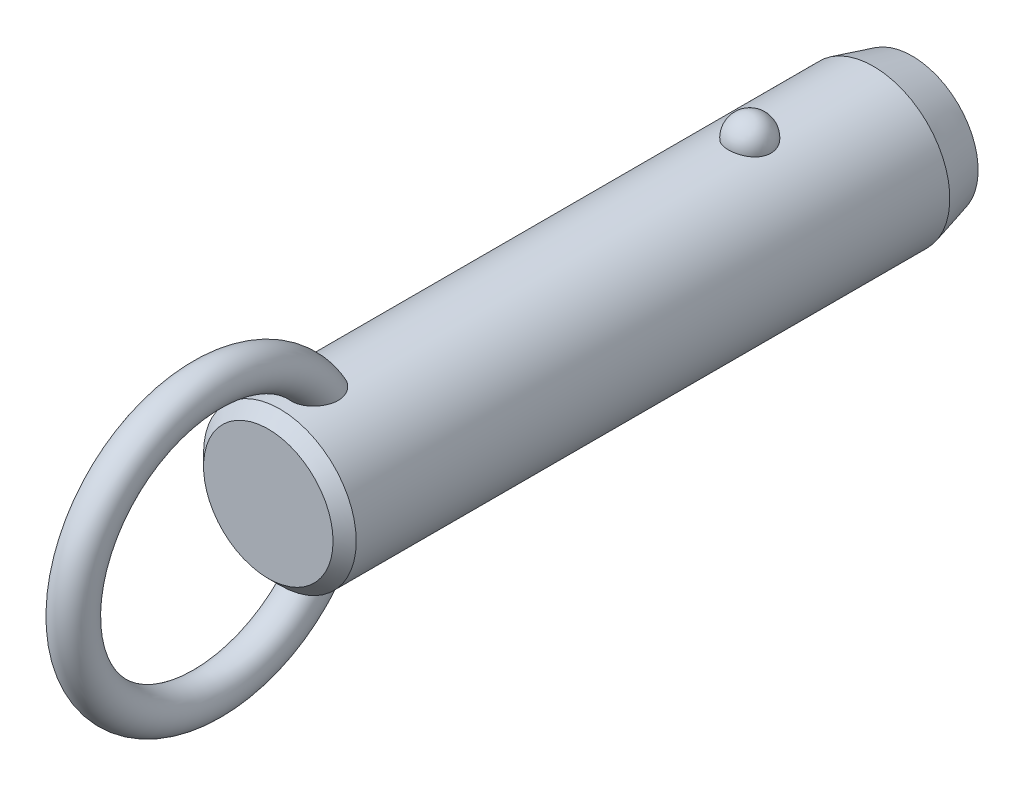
ISO-10303-21;
HEADER;
FILE_DESCRIPTION(('STEP AP214'),'2;1');
FILE_NAME('part.step','',(''),(''),'','','');
FILE_SCHEMA(('AUTOMOTIVE_DESIGN { 1 0 10303 214 1 1 1 1 }'));
ENDSEC;
DATA;
#1=APPLICATION_CONTEXT('core data for automotive mechanical design processes');
#2=APPLICATION_PROTOCOL_DEFINITION('international standard','automotive_design',2000,#1);
#3=PRODUCT_CONTEXT('',#1,'mechanical');
#4=PRODUCT('Part','Part','',(#3));
#5=PRODUCT_RELATED_PRODUCT_CATEGORY('part','',(#4));
#6=PRODUCT_DEFINITION_FORMATION('','',#4);
#7=PRODUCT_DEFINITION_CONTEXT('part definition',#1,'design');
#8=PRODUCT_DEFINITION('design','',#6,#7);
#9=PRODUCT_DEFINITION_SHAPE('','',#8);
#10=(LENGTH_UNIT() NAMED_UNIT(*) SI_UNIT(.MILLI.,.METRE.));
#11=(NAMED_UNIT(*) PLANE_ANGLE_UNIT() SI_UNIT($,.RADIAN.));
#12=(NAMED_UNIT(*) SI_UNIT($,.STERADIAN.) SOLID_ANGLE_UNIT());
#13=UNCERTAINTY_MEASURE_WITH_UNIT(LENGTH_MEASURE(1.E-05),#10,'distance_accuracy_value','');
#14=(GEOMETRIC_REPRESENTATION_CONTEXT(3) GLOBAL_UNCERTAINTY_ASSIGNED_CONTEXT((#13)) GLOBAL_UNIT_ASSIGNED_CONTEXT((#10,
#11,#12)) REPRESENTATION_CONTEXT('',''));
#15=CARTESIAN_POINT('',(0.,0.,0.));
#16=DIRECTION('',(0.,0.,1.));
#17=DIRECTION('',(1.,0.,0.));
#18=AXIS2_PLACEMENT_3D('',#15,#16,#17);
#19=CARTESIAN_POINT('',(0.,0.,38.1));
#20=DIRECTION('',(0.,0.,-1.));
#21=DIRECTION('',(-1.,0.,0.));
#22=AXIS2_PLACEMENT_3D('',#19,#20,#21);
#23=CYLINDRICAL_SURFACE('',#22,7.9);
#24=CARTESIAN_POINT('',(2.1785689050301,7.59367088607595,-2.2));
#25=CARTESIAN_POINT('',(2.17856679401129,7.59367269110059,-2.07701843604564));
#26=CARTESIAN_POINT('',(2.16853481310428,7.59657145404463,-1.95401006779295));
#27=CARTESIAN_POINT('',(2.12864689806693,7.607843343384,-1.71147811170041));
#28=CARTESIAN_POINT('',(2.09878338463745,7.61621856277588,-1.59195587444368));
#29=CARTESIAN_POINT('',(2.0199931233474,7.63749180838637,-1.35985638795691));
#30=CARTESIAN_POINT('',(1.97107475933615,7.6503878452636,-1.24727610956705));
#31=CARTESIAN_POINT('',(1.85539377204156,7.67926115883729,-1.03213234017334));
#32=CARTESIAN_POINT('',(1.78863158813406,7.69523835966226,-0.929568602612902));
#33=CARTESIAN_POINT('',(1.63856494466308,7.7285848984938,-0.736786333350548));
#34=CARTESIAN_POINT('',(1.55518140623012,7.7459606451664,-0.646630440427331));
#35=CARTESIAN_POINT('',(1.37422937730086,7.78009978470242,-0.481747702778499));
#36=CARTESIAN_POINT('',(1.27666086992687,7.79686317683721,-0.407020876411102));
#37=CARTESIAN_POINT('',(1.07024728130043,7.82786153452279,-0.27527810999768));
#38=CARTESIAN_POINT('',(0.961434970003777,7.84210353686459,-0.218212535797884));
#39=CARTESIAN_POINT('',(0.735351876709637,7.86652194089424,-0.123146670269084));
#40=CARTESIAN_POINT('',(0.618082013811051,7.87669878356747,-0.0851443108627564));
#41=CARTESIAN_POINT('',(0.380637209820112,7.89170521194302,-0.0298158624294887));
#42=CARTESIAN_POINT('',(0.260550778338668,7.89662650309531,-0.0121347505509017));
#43=CARTESIAN_POINT('',(0.0190117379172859,7.90090003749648,0.00324379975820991));
#44=CARTESIAN_POINT('',(-0.102440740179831,7.90025280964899,0.000943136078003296));
#45=CARTESIAN_POINT('',(-0.341452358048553,7.89351056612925,-0.0233955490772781));
#46=CARTESIAN_POINT('',(-0.459042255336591,7.88749257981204,-0.0451545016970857));
#47=CARTESIAN_POINT('',(-0.688796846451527,7.87075812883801,-0.107408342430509));
#48=CARTESIAN_POINT('',(-0.800961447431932,7.86004158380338,-0.147903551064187));
#49=CARTESIAN_POINT('',(-1.01743634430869,7.83497131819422,-0.246799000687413));
#50=CARTESIAN_POINT('',(-1.12169791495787,7.82059709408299,-0.305300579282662));
#51=CARTESIAN_POINT('',(-1.31891765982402,7.78976470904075,-0.438549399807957));
#52=CARTESIAN_POINT('',(-1.41187469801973,7.77330633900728,-0.51329827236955));
#53=CARTESIAN_POINT('',(-1.58577142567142,7.73972434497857,-0.67862264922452));
#54=CARTESIAN_POINT('',(-1.66645140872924,7.72259402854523,-0.769470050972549));
#55=CARTESIAN_POINT('',(-1.81161503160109,7.68983776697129,-0.963538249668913));
#56=CARTESIAN_POINT('',(-1.87609753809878,7.6742119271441,-1.06675991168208));
#57=CARTESIAN_POINT('',(-1.98790138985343,7.6460202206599,-1.28401170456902));
#58=CARTESIAN_POINT('',(-2.03501994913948,7.63349104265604,-1.39815107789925));
#59=CARTESIAN_POINT('',(-2.10986724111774,7.6131449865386,-1.63301784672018));
#60=CARTESIAN_POINT('',(-2.1375965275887,7.60532797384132,-1.75374505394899));
#61=CARTESIAN_POINT('',(-2.17289256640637,7.59531950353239,-1.99782562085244));
#62=CARTESIAN_POINT('',(-2.18054294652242,7.59310471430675,-2.12116592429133));
#63=CARTESIAN_POINT('',(-2.17572919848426,7.59448538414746,-2.36741799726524));
#64=CARTESIAN_POINT('',(-2.1632656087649,7.59808068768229,-2.49032977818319));
#65=CARTESIAN_POINT('',(-2.11865035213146,7.61064035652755,-2.73161015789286));
#66=CARTESIAN_POINT('',(-2.08659579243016,7.61957823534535,-2.84999812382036));
#67=CARTESIAN_POINT('',(-2.00367799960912,7.64179982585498,-3.07955956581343));
#68=CARTESIAN_POINT('',(-1.9528140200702,7.65508371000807,-3.19073275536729));
#69=CARTESIAN_POINT('',(-1.83321113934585,7.68460381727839,-3.40337899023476));
#70=CARTESIAN_POINT('',(-1.76437735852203,7.70085556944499,-3.50479651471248));
#71=CARTESIAN_POINT('',(-1.61069526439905,7.73445734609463,-3.69446912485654));
#72=CARTESIAN_POINT('',(-1.52584634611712,7.75180741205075,-3.78272371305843));
#73=CARTESIAN_POINT('',(-1.34198059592,7.78574608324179,-3.94393987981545));
#74=CARTESIAN_POINT('',(-1.24291308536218,7.80233167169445,-4.01684434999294));
#75=CARTESIAN_POINT('',(-1.03352039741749,7.83281625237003,-4.14489386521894));
#76=CARTESIAN_POINT('',(-0.923196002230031,7.84671543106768,-4.20004014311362));
#77=CARTESIAN_POINT('',(-0.695822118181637,7.87011575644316,-4.29042017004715));
#78=CARTESIAN_POINT('',(-0.578872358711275,7.87966903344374,-4.32589112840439));
#79=CARTESIAN_POINT('',(-0.340410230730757,7.8935652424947,-4.37692226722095));
#80=CARTESIAN_POINT('',(-0.218898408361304,7.89790879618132,-4.39248482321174));
#81=CARTESIAN_POINT('',(0.0228107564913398,7.90087453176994,-4.4031440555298));
#82=CARTESIAN_POINT('',(0.142990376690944,7.89960185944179,-4.3986168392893));
#83=CARTESIAN_POINT('',(0.380829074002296,7.89171262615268,-4.37008293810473));
#84=CARTESIAN_POINT('',(0.498488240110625,7.8850962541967,-4.34607694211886));
#85=CARTESIAN_POINT('',(0.727535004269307,7.86726442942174,-4.27939317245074));
#86=CARTESIAN_POINT('',(0.838944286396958,7.85606616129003,-4.23678512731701));
#87=CARTESIAN_POINT('',(1.05295421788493,7.83025654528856,-4.13408348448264));
#88=CARTESIAN_POINT('',(1.15555431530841,7.81564498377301,-4.07398879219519));
#89=CARTESIAN_POINT('',(1.35076763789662,7.7843022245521,-3.93687432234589));
#90=CARTESIAN_POINT('',(1.4432046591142,7.76754209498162,-3.85961036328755));
#91=CARTESIAN_POINT('',(1.6139111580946,7.73387857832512,-3.69076949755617));
#92=CARTESIAN_POINT('',(1.6921781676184,7.71697516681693,-3.59919010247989));
#93=CARTESIAN_POINT('',(1.83380875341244,7.6845643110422,-3.40247278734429));
#94=CARTESIAN_POINT('',(1.89689280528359,7.66908588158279,-3.29712873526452));
#95=CARTESIAN_POINT('',(2.0047823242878,7.64159441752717,-3.07707931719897));
#96=CARTESIAN_POINT('',(2.0495945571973,7.62958010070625,-2.96237743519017));
#97=CARTESIAN_POINT('',(2.11580183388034,7.61146617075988,-2.74040519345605));
#98=CARTESIAN_POINT('',(2.13929812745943,7.60484503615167,-2.63379846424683));
#99=CARTESIAN_POINT('',(2.17068242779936,7.59594664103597,-2.41813481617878));
#100=CARTESIAN_POINT('',(2.17857077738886,7.59366928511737,-2.30907795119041));
#101=CARTESIAN_POINT('',(2.1785689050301,7.59367088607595,-2.2));
#102=B_SPLINE_CURVE_WITH_KNOTS('',3,(#24,#25,#26,#27,#28,#29,#30,#31,#32,#33,#34,#35,#36,#37,
#38,#39,#40,#41,#42,#43,#44,#45,#46,#47,#48,#49,#50,#51,#52,#53,#54,#55,#56,#57,#58,#59,#60,#61,
#62,#63,#64,#65,#66,#67,#68,#69,#70,#71,#72,#73,#74,#75,#76,#77,#78,#79,#80,#81,#82,#83,#84,#85,
#86,#87,#88,#89,#90,#91,#92,#93,#94,#95,#96,#97,#98,#99,#100,#101),.UNSPECIFIED.,.T.,.F.,(4,2,2,
2,2,2,2,2,2,2,2,2,2,2,2,2,2,2,2,2,2,2,2,2,2,2,2,2,2,2,2,2,2,2,2,2,2,2,4),(0.,0.368552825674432,
0.737246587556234,1.10577831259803,1.4743009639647,1.84462067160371,2.21494081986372,
2.5842105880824,2.95344028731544,3.31611630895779,3.67875788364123,4.03628044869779,
4.39380913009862,4.75338791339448,5.11300280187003,5.47939989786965,5.8458226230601,
6.21639834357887,6.58696347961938,6.95598276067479,7.32499216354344,7.69218715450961,
8.0593967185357,8.42858578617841,8.79778880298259,9.16834203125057,9.5388695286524,
9.90482699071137,10.2707407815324,10.6298333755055,10.9889132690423,11.3466585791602,
11.7044262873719,12.0676511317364,12.4309391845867,12.8004764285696,13.1698767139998,
13.4967701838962,13.8236564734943),.UNSPECIFIED.);
#103=CARTESIAN_POINT('',(2.1785689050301,7.59367088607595,-2.2));
#104=VERTEX_POINT('',#103);
#105=EDGE_CURVE('E41',#104,#104,#102,.T.);
#106=ORIENTED_EDGE('',*,*,#105,.T.);
#107=EDGE_LOOP('',(#106));
#108=FACE_BOUND('',#107,.T.);
#109=CARTESIAN_POINT('',(0.,0.,46.42));
#110=DIRECTION('',(0.,0.,1.));
#111=DIRECTION('',(1.,0.,0.));
#112=AXIS2_PLACEMENT_3D('',#109,#110,#111);
#113=CIRCLE('',#112,7.9);
#114=CARTESIAN_POINT('',(7.9,0.,46.42));
#115=VERTEX_POINT('',#114);
#116=EDGE_CURVE('E10',#115,#115,#113,.F.);
#117=ORIENTED_EDGE('',*,*,#116,.T.);
#118=EDGE_LOOP('',(#117));
#119=FACE_BOUND('',#118,.T.);
#120=CARTESIAN_POINT('',(-0.63096985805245,-7.87476203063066,40.3124322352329));
#121=CARTESIAN_POINT('',(-0.734180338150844,-7.8664899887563,40.347285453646));
#122=CARTESIAN_POINT('',(-0.834476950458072,-7.85639291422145,40.3908160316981));
#123=CARTESIAN_POINT('',(-1.0262035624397,-7.83366343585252,40.4940948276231));
#124=CARTESIAN_POINT('',(-1.1176141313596,-7.82102565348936,40.5538775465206));
#125=CARTESIAN_POINT('',(-1.28877277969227,-7.79464922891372,40.6878390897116));
#126=CARTESIAN_POINT('',(-1.36854014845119,-7.78091246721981,40.761993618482));
#127=CARTESIAN_POINT('',(-1.51461521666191,-7.75380398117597,40.9224941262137));
#128=CARTESIAN_POINT('',(-1.58092966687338,-7.74043207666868,41.0088339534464));
#129=CARTESIAN_POINT('',(-1.70019064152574,-7.7151252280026,41.1929784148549));
#130=CARTESIAN_POINT('',(-1.75284037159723,-7.70322473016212,41.2909792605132));
#131=CARTESIAN_POINT('',(-1.84263464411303,-7.68224112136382,41.4941029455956));
#132=CARTESIAN_POINT('',(-1.87977299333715,-7.6731591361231,41.5992286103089));
#133=CARTESIAN_POINT('',(-1.94152728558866,-7.65777930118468,41.8232849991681));
#134=CARTESIAN_POINT('',(-1.96475471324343,-7.65179654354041,41.9426167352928));
#135=CARTESIAN_POINT('',(-1.99449499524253,-7.64409642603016,42.1834298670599));
#136=CARTESIAN_POINT('',(-2.0010005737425,-7.64238092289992,42.3049121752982));
#137=CARTESIAN_POINT('',(-1.99856014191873,-7.64302120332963,42.5683409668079));
#138=CARTESIAN_POINT('',(-1.98680021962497,-7.64611845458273,42.7102565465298));
#139=CARTESIAN_POINT('',(-1.94457772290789,-7.65696186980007,42.9911188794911));
#140=CARTESIAN_POINT('',(-1.91409393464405,-7.66471330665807,43.1300620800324));
#141=CARTESIAN_POINT('',(-1.82768670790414,-7.68582947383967,43.431939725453));
#142=CARTESIAN_POINT('',(-1.76772963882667,-7.70003779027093,43.593686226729));
#143=CARTESIAN_POINT('',(-1.65998501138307,-7.72371550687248,43.8276956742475));
#144=CARTESIAN_POINT('',(-1.621079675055,-7.73200670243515,43.9042974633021));
#145=CARTESIAN_POINT('',(-1.53727726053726,-7.74910377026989,44.0540798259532));
#146=CARTESIAN_POINT('',(-1.4923821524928,-7.75790947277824,44.1272615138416));
#147=CARTESIAN_POINT('',(-1.37397050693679,-7.77993338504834,44.3028838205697));
#148=CARTESIAN_POINT('',(-1.29690364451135,-7.79328473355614,44.4029557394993));
#149=CARTESIAN_POINT('',(-1.12885487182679,-7.81939266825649,44.5907147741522));
#150=CARTESIAN_POINT('',(-1.03789926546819,-7.83215032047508,44.6784247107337));
#151=CARTESIAN_POINT('',(-0.869532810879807,-7.85231710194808,44.8134148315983));
#152=CARTESIAN_POINT('',(-0.795716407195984,-7.86021093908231,44.865076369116));
#153=CARTESIAN_POINT('',(-0.640813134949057,-7.87434920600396,44.9563815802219));
#154=CARTESIAN_POINT('',(-0.559737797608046,-7.88059619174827,44.9960438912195));
#155=CARTESIAN_POINT('',(-0.406456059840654,-7.88984116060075,45.0543008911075));
#156=CARTESIAN_POINT('',(-0.335227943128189,-7.89321892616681,45.0753848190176));
#157=CARTESIAN_POINT('',(-0.19019307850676,-7.89804235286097,45.1054141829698));
#158=CARTESIAN_POINT('',(-0.116388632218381,-7.89948969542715,45.1143701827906));
#159=CARTESIAN_POINT('',(0.0318414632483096,-7.90028409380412,45.1192915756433));
#160=CARTESIAN_POINT('',(0.106268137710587,-7.89962640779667,45.1152276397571));
#161=CARTESIAN_POINT('',(0.253290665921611,-7.8962818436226,45.0944615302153));
#162=CARTESIAN_POINT('',(0.325885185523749,-7.8935935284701,45.0777504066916));
#163=CARTESIAN_POINT('',(0.481441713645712,-7.88577340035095,45.0287380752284));
#164=CARTESIAN_POINT('',(0.563611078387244,-7.88026321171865,44.994005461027));
#165=CARTESIAN_POINT('',(0.72112962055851,-7.86741729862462,44.9117965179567));
#166=CARTESIAN_POINT('',(0.796466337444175,-7.86007832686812,44.8642975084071));
#167=CARTESIAN_POINT('',(0.971456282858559,-7.84073285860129,44.736513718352));
#168=CARTESIAN_POINT('',(1.06719686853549,-7.82809461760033,44.6510047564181));
#169=CARTESIAN_POINT('',(1.24418921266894,-7.80192439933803,44.466232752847));
#170=CARTESIAN_POINT('',(1.32540832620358,-7.78839049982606,44.3669395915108));
#171=CARTESIAN_POINT('',(1.45199971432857,-7.76559693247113,44.1895760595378));
#172=CARTESIAN_POINT('',(1.5008564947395,-7.75626094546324,44.1139542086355));
#173=CARTESIAN_POINT('',(1.59197749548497,-7.7380727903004,43.9587428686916));
#174=CARTESIAN_POINT('',(1.63423919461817,-7.72922080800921,43.8791518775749));
#175=CARTESIAN_POINT('',(1.71222612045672,-7.71231959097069,43.7166640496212));
#176=CARTESIAN_POINT('',(1.7479451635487,-7.70427111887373,43.633764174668));
#177=CARTESIAN_POINT('',(1.81270113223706,-7.68929240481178,43.4652967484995));
#178=CARTESIAN_POINT('',(1.84173789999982,-7.68236218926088,43.3797291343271));
#179=CARTESIAN_POINT('',(1.89322698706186,-7.6698375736,43.2052870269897));
#180=CARTESIAN_POINT('',(1.91558744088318,-7.66426199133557,43.1163838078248));
#181=CARTESIAN_POINT('',(1.95281367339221,-7.65485915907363,42.9369696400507));
#182=CARTESIAN_POINT('',(1.96767946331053,-7.65103190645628,42.8464586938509));
#183=CARTESIAN_POINT('',(2.00021456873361,-7.64262981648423,42.5737320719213));
#184=CARTESIAN_POINT('',(2.00600691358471,-7.6410871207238,42.3897099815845));
#185=CARTESIAN_POINT('',(1.98445334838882,-7.64669564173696,42.0765019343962));
#186=CARTESIAN_POINT('',(1.96607186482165,-7.65149688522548,41.946618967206));
#187=CARTESIAN_POINT('',(1.90884967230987,-7.6659762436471,41.6916321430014));
#188=CARTESIAN_POINT('',(1.87002101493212,-7.67565148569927,41.566525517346));
#189=CARTESIAN_POINT('',(1.77063986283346,-7.69918471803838,41.3245401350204));
#190=CARTESIAN_POINT('',(1.70993724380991,-7.71307150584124,41.2077250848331));
#191=CARTESIAN_POINT('',(1.56733070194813,-7.74330306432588,40.9881444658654));
#192=CARTESIAN_POINT('',(1.48543692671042,-7.75964665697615,40.8853722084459));
#193=CARTESIAN_POINT('',(1.31346177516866,-7.79047523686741,40.7093800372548));
#194=CARTESIAN_POINT('',(1.22547278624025,-7.80495298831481,40.6341066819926));
#195=CARTESIAN_POINT('',(1.03724352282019,-7.83218597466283,40.5004864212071));
#196=CARTESIAN_POINT('',(0.937008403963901,-7.84494192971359,40.4421324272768));
#197=CARTESIAN_POINT('',(0.733599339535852,-7.86649045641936,40.3470270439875));
#198=CARTESIAN_POINT('',(0.630941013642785,-7.87547134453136,40.3092109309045));
#199=CARTESIAN_POINT('',(0.420465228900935,-7.88950708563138,40.2511160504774));
#200=CARTESIAN_POINT('',(0.312645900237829,-7.89456050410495,40.2308436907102));
#201=CARTESIAN_POINT('',(0.0960869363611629,-7.9001518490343,40.2084559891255));
#202=CARTESIAN_POINT('',(-0.0126341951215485,-7.90073226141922,40.2061698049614));
#203=CARTESIAN_POINT('',(-0.228766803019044,-7.89742350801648,40.2193678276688));
#204=CARTESIAN_POINT('',(-0.336180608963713,-7.89354403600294,40.2348134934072));
#205=CARTESIAN_POINT('',(-0.473410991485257,-7.88586871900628,40.2662177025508));
#206=CARTESIAN_POINT('',(-0.505257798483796,-7.88388984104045,40.2743541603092));
#207=CARTESIAN_POINT('',(-0.568481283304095,-7.87958326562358,40.2922083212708));
#208=CARTESIAN_POINT('',(-0.599857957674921,-7.87725556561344,40.3019260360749));
#209=CARTESIAN_POINT('',(-0.63096985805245,-7.87476203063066,40.3124322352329));
#210=B_SPLINE_CURVE_WITH_KNOTS('',3,(#120,#121,#122,#123,#124,#125,#126,#127,#128,#129,#130,
#131,#132,#133,#134,#135,#136,#137,#138,#139,#140,#141,#142,#143,#144,#145,#146,#147,#148,#149,
#150,#151,#152,#153,#154,#155,#156,#157,#158,#159,#160,#161,#162,#163,#164,#165,#166,#167,#168,
#169,#170,#171,#172,#173,#174,#175,#176,#177,#178,#179,#180,#181,#182,#183,#184,#185,#186,#187,
#188,#189,#190,#191,#192,#193,#194,#195,#196,#197,#198,#199,#200,#201,#202,#203,#204,#205,#206,
#207,#208,#209),.UNSPECIFIED.,.T.,.F.,(4,2,2,2,2,2,2,2,2,2,2,2,2,2,2,2,2,2,2,2,2,2,2,2,2,2,2,2,
2,2,2,2,2,2,2,2,2,2,2,2,2,2,2,2,4),(0.,0.327622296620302,0.65594559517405,0.983718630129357,
1.3113267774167,1.64554655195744,1.97989964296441,2.34365728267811,2.70757317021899,
3.13333684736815,3.55958380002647,4.07655306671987,4.3352789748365,4.593919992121,
4.9738243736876,5.35301797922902,5.62348245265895,5.89352465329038,6.11565959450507,
6.3376009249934,6.56004255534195,6.782641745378,7.04930844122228,7.31645206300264,
7.70130871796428,8.08701995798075,8.35824509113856,8.62957365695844,8.90115735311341,
9.17274746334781,9.44791855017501,9.72308922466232,10.2715298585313,10.6638393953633,
11.0559179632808,11.4507403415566,11.8453740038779,12.1936425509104,12.5417649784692,
12.8695063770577,13.1973674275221,13.5221104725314,13.8461490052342,13.9449071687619,
14.0436660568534),.UNSPECIFIED.);
#211=CARTESIAN_POINT('',(-0.63096985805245,-7.87476203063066,40.3124322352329));
#212=VERTEX_POINT('',#211);
#213=EDGE_CURVE('E60',#212,#212,#210,.T.);
#214=ORIENTED_EDGE('',*,*,#213,.T.);
#215=EDGE_LOOP('',(#214));
#216=FACE_BOUND('',#215,.T.);
#217=CARTESIAN_POINT('',(-0.63096985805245,7.87476203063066,40.3124322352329));
#218=CARTESIAN_POINT('',(-0.528918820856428,7.88293636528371,40.2779798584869));
#219=CARTESIAN_POINT('',(-0.423745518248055,7.88934810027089,40.251915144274));
#220=CARTESIAN_POINT('',(-0.21023608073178,7.8979273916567,40.2172825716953));
#221=CARTESIAN_POINT('',(-0.10189380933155,7.90008607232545,40.2087513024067));
#222=CARTESIAN_POINT('',(0.114660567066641,7.89990877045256,40.2094570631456));
#223=CARTESIAN_POINT('',(0.222872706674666,7.89757640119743,40.2186798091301));
#224=CARTESIAN_POINT('',(0.436107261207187,7.88867538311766,40.2546525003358));
#225=CARTESIAN_POINT('',(0.541131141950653,7.8821087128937,40.2813942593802));
#226=CARTESIAN_POINT('',(0.74508556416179,7.86545130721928,40.3517561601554));
#227=CARTESIAN_POINT('',(0.844015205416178,7.85536005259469,40.3953787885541));
#228=CARTESIAN_POINT('',(1.03299167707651,7.83275153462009,40.4983796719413));
#229=CARTESIAN_POINT('',(1.12303841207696,7.8202342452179,40.5577580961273));
#230=CARTESIAN_POINT('',(1.29214734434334,7.79408219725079,40.6908647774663));
#231=CARTESIAN_POINT('',(1.37116907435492,7.78044359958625,40.7646436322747));
#232=CARTESIAN_POINT('',(1.51597677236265,7.75353170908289,40.9242353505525));
#233=CARTESIAN_POINT('',(1.58176261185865,7.74025841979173,41.0100483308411));
#234=CARTESIAN_POINT('',(1.70057386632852,7.71504069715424,41.193644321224));
#235=CARTESIAN_POINT('',(1.75320073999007,7.7031425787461,41.2916906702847));
#236=CARTESIAN_POINT('',(1.8429376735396,7.68216822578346,41.4948931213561));
#237=CARTESIAN_POINT('',(1.88004278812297,7.67309289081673,41.6000514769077));
#238=CARTESIAN_POINT('',(1.9417232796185,7.6577294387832,41.8241671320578));
#239=CARTESIAN_POINT('',(1.96491037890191,7.65175648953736,41.9435248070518));
#240=CARTESIAN_POINT('',(1.9945689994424,7.64407702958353,42.1843848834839));
#241=CARTESIAN_POINT('',(2.00103304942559,7.64237242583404,42.3058882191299));
#242=CARTESIAN_POINT('',(1.99850166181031,7.64303650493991,42.5693688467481));
#243=CARTESIAN_POINT('',(1.98669038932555,7.64614714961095,42.7113141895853));
#244=CARTESIAN_POINT('',(1.94436120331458,7.6570170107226,42.9922287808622));
#245=CARTESIAN_POINT('',(1.91382203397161,7.66478150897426,43.1311944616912));
#246=CARTESIAN_POINT('',(1.82728754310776,7.68592483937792,43.4331110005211));
#247=CARTESIAN_POINT('',(1.76725778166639,7.7001468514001,43.594872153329));
#248=CARTESIAN_POINT('',(1.65939700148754,7.72384204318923,43.8288914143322));
#249=CARTESIAN_POINT('',(1.62045187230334,7.73213852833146,43.9054942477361));
#250=CARTESIAN_POINT('',(1.53656684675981,7.74924489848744,44.0552737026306));
#251=CARTESIAN_POINT('',(1.49162892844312,7.75805461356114,44.1284514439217));
#252=CARTESIAN_POINT('',(1.37317698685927,7.78007342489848,44.3039520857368));
#253=CARTESIAN_POINT('',(1.29612360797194,7.79341423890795,44.4039112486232));
#254=CARTESIAN_POINT('',(1.12812043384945,7.81949839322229,44.5914508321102));
#255=CARTESIAN_POINT('',(1.0371968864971,7.83224280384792,44.6790540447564));
#256=CARTESIAN_POINT('',(0.868871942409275,7.85239026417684,44.8138971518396));
#257=CARTESIAN_POINT('',(0.795056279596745,7.86027769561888,44.8655113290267));
#258=CARTESIAN_POINT('',(0.640160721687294,7.87440222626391,44.9567201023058));
#259=CARTESIAN_POINT('',(0.559092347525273,7.88064188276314,44.9963333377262));
#260=CARTESIAN_POINT('',(0.405820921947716,7.8898738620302,45.0545056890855));
#261=CARTESIAN_POINT('',(0.334594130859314,7.89324577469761,45.0755523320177));
#262=CARTESIAN_POINT('',(0.189568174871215,7.89805733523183,45.1055070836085));
#263=CARTESIAN_POINT('',(0.115771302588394,7.89949866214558,45.1144257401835));
#264=CARTESIAN_POINT('',(-0.0324359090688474,7.90028156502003,45.1192758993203));
#265=CARTESIAN_POINT('',(-0.106847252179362,7.89961843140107,45.1151782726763));
#266=CARTESIAN_POINT('',(-0.253834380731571,7.8962642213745,45.0943519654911));
#267=CARTESIAN_POINT('',(-0.326408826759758,7.89357170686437,45.0776143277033));
#268=CARTESIAN_POINT('',(-0.481962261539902,7.88574179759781,45.0285391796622));
#269=CARTESIAN_POINT('',(-0.56414552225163,7.88022507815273,44.9937638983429));
#270=CARTESIAN_POINT('',(-0.721685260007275,7.8673664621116,44.9114686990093));
#271=CARTESIAN_POINT('',(-0.797029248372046,7.8600213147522,44.8639260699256));
#272=CARTESIAN_POINT('',(-0.972044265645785,7.84066026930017,44.7360267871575));
#273=CARTESIAN_POINT('',(-1.06779803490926,7.82801274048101,44.6504436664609));
#274=CARTESIAN_POINT('',(-1.24480531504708,7.80182621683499,44.4655223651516));
#275=CARTESIAN_POINT('',(-1.32602618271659,7.78828530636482,44.3661540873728));
#276=CARTESIAN_POINT('',(-1.45259834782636,7.76548487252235,44.1886806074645));
#277=CARTESIAN_POINT('',(-1.50143856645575,7.75614818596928,44.1130252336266));
#278=CARTESIAN_POINT('',(-1.59252410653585,7.73796020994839,43.9577484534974));
#279=CARTESIAN_POINT('',(-1.63476690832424,7.72910910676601,43.8781255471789));
#280=CARTESIAN_POINT('',(-1.71271318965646,7.71221133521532,43.7155750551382));
#281=CARTESIAN_POINT('',(-1.74841047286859,7.70416543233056,43.6326444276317));
#282=CARTESIAN_POINT('',(-1.81311929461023,7.6891937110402,43.4641168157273));
#283=CARTESIAN_POINT('',(-1.84213067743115,7.6822679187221,43.3785197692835));
#284=CARTESIAN_POINT('',(-1.89356259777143,7.66975461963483,43.2040254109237));
#285=CARTESIAN_POINT('',(-1.91589165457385,7.66418586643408,43.1150995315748));
#286=CARTESIAN_POINT('',(-1.95305070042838,7.65479859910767,42.9356424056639));
#287=CARTESIAN_POINT('',(-1.96788069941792,7.65098008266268,42.8451111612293));
#288=CARTESIAN_POINT('',(-2.00030078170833,7.64260704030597,42.5723270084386));
#289=CARTESIAN_POINT('',(-2.00600576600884,7.64108760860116,42.3882718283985));
#290=CARTESIAN_POINT('',(-1.98428483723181,7.64673945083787,42.0750800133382));
#291=CARTESIAN_POINT('',(-1.96583698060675,7.6515575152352,41.9452400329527));
#292=CARTESIAN_POINT('',(-1.90848948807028,7.66606613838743,41.6903619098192));
#293=CARTESIAN_POINT('',(-1.86960376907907,7.67575338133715,41.565320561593));
#294=CARTESIAN_POINT('',(-1.7701342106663,7.6993013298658,41.3235009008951));
#295=CARTESIAN_POINT('',(-1.70940488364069,7.71318991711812,41.2067844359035));
#296=CARTESIAN_POINT('',(-1.56672953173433,7.74342495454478,40.9873404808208));
#297=CARTESIAN_POINT('',(-1.48478316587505,7.75977144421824,40.8846132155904));
#298=CARTESIAN_POINT('',(-1.31266325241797,7.79061163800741,40.708643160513));
#299=CARTESIAN_POINT('',(-1.22456383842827,7.80509908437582,40.6333589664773));
#300=CARTESIAN_POINT('',(-1.03622400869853,7.83231881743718,40.4998659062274));
#301=CARTESIAN_POINT('',(-0.936015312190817,7.84505551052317,40.4416137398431));
#302=CARTESIAN_POINT('',(-0.798824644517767,7.85957802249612,40.3775408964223));
#303=CARTESIAN_POINT('',(-0.765787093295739,7.86286821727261,40.3632248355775));
#304=CARTESIAN_POINT('',(-0.698939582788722,7.86909211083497,40.336436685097));
#305=CARTESIAN_POINT('',(-0.665129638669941,7.8720258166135,40.3239645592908));
#306=CARTESIAN_POINT('',(-0.63096985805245,7.87476203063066,40.3124322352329));
#307=B_SPLINE_CURVE_WITH_KNOTS('',3,(#217,#218,#219,#220,#221,#222,#223,#224,#225,#226,#227,
#228,#229,#230,#231,#232,#233,#234,#235,#236,#237,#238,#239,#240,#241,#242,#243,#244,#245,#246,
#247,#248,#249,#250,#251,#252,#253,#254,#255,#256,#257,#258,#259,#260,#261,#262,#263,#264,#265,
#266,#267,#268,#269,#270,#271,#272,#273,#274,#275,#276,#277,#278,#279,#280,#281,#282,#283,#284,
#285,#286,#287,#288,#289,#290,#291,#292,#293,#294,#295,#296,#297,#298,#299,#300,#301,#302,#303,
#304,#305,#306),.UNSPECIFIED.,.T.,.F.,(4,2,2,2,2,2,2,2,2,2,2,2,2,2,2,2,2,2,2,2,2,2,2,2,2,2,2,2,
2,2,2,2,2,2,2,2,2,2,2,2,2,2,2,2,4),(0.,0.323920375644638,0.648516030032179,0.972850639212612,
1.29703380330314,1.62126473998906,1.94549915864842,2.27089401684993,2.59629203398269,
2.93059633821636,3.26500707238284,3.62881644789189,3.99278833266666,4.41865421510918,
4.84500434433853,5.36209210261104,5.62087589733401,5.87957448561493,6.25918598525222,
6.6380878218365,6.90846748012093,7.17842501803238,7.40052350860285,7.62242871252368,
7.84483086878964,8.06739077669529,8.33414615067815,8.60137921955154,8.98641454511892,
9.37230415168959,9.64358673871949,9.91497268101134,10.1866142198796,10.4582620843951,
10.7334745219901,11.0086865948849,11.5572126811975,11.9494246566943,12.3413699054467,
12.7359755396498,13.1305875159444,13.4791770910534,13.82687259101,13.9353013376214,
14.0437279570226),.UNSPECIFIED.);
#308=CARTESIAN_POINT('',(-0.63096985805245,7.87476203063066,40.3124322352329));
#309=VERTEX_POINT('',#308);
#310=EDGE_CURVE('E68',#309,#309,#307,.T.);
#311=ORIENTED_EDGE('',*,*,#310,.T.);
#312=EDGE_LOOP('',(#311));
#313=FACE_BOUND('',#312,.T.);
#314=CARTESIAN_POINT('',(0.,0.,-15.));
#315=DIRECTION('',(0.,0.,-1.));
#316=DIRECTION('',(-1.,0.,0.));
#317=AXIS2_PLACEMENT_3D('',#314,#315,#316);
#318=CIRCLE('',#317,7.9);
#319=CARTESIAN_POINT('',(-7.9,0.,-15.));
#320=VERTEX_POINT('',#319);
#321=EDGE_CURVE('E57',#320,#320,#318,.F.);
#322=ORIENTED_EDGE('',*,*,#321,.T.);
#323=EDGE_LOOP('',(#322));
#324=FACE_BOUND('',#323,.T.);
#325=ADVANCED_FACE('F37',(#108,#119,#216,#313,#324),#23,.T.);
#326=CARTESIAN_POINT('',(0.,0.,-19.));
#327=DIRECTION('',(0.,0.,-1.));
#328=DIRECTION('',(-1.,0.,0.));
#329=AXIS2_PLACEMENT_3D('',#326,#327,#328);
#330=PLANE('',#329);
#331=CARTESIAN_POINT('',(0.,0.,-19.));
#332=DIRECTION('',(0.,0.,-1.));
#333=DIRECTION('',(-1.,0.,0.));
#334=AXIS2_PLACEMENT_3D('',#331,#332,#333);
#335=CIRCLE('',#334,6.82820323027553);
#336=CARTESIAN_POINT('',(-6.82820323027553,0.,-19.));
#337=VERTEX_POINT('',#336);
#338=EDGE_CURVE('E67',#337,#337,#335,.T.);
#339=ORIENTED_EDGE('',*,*,#338,.T.);
#340=EDGE_LOOP('',(#339));
#341=FACE_BOUND('',#340,.T.);
#342=ADVANCED_FACE('F86',(#341),#330,.T.);
#343=CARTESIAN_POINT('',(0.,0.,-19.));
#344=DIRECTION('',(0.,0.,1.));
#345=DIRECTION('',(1.,0.,0.));
#346=AXIS2_PLACEMENT_3D('',#343,#344,#345);
#347=CONICAL_SURFACE('',#346,6.82820323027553,0.261799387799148);
#348=ORIENTED_EDGE('',*,*,#321,.F.);
#349=EDGE_LOOP('',(#348));
#350=FACE_BOUND('',#349,.T.);
#351=ORIENTED_EDGE('',*,*,#338,.F.);
#352=EDGE_LOOP('',(#351));
#353=FACE_BOUND('',#352,.T.);
#354=ADVANCED_FACE('F84',(#350,#353),#347,.T.);
#355=CARTESIAN_POINT('',(0.,0.,47.62));
#356=DIRECTION('',(0.,0.,1.));
#357=DIRECTION('',(1.,0.,0.));
#358=AXIS2_PLACEMENT_3D('',#355,#356,#357);
#359=PLANE('',#358);
#360=CARTESIAN_POINT('',(0.,0.,47.62));
#361=DIRECTION('',(0.,0.,1.));
#362=DIRECTION('',(1.,0.,0.));
#363=AXIS2_PLACEMENT_3D('',#360,#361,#362);
#364=CIRCLE('',#363,6.70000000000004);
#365=CARTESIAN_POINT('',(6.70000000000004,0.,47.62));
#366=VERTEX_POINT('',#365);
#367=EDGE_CURVE('E50',#366,#366,#364,.T.);
#368=ORIENTED_EDGE('',*,*,#367,.T.);
#369=EDGE_LOOP('',(#368));
#370=FACE_BOUND('',#369,.T.);
#371=ADVANCED_FACE('F78',(#370),#359,.T.);
#372=CARTESIAN_POINT('',(0.,0.,53.95));
#373=DIRECTION('',(1.,0.,0.));
#374=DIRECTION('',(0.,0.,-1.));
#375=AXIS2_PLACEMENT_3D('',#372,#373,#374);
#376=TOROIDAL_SURFACE('',#375,13.85,2.);
#377=ORIENTED_EDGE('',*,*,#310,.F.);
#378=EDGE_LOOP('',(#377));
#379=FACE_BOUND('',#378,.T.);
#380=ORIENTED_EDGE('',*,*,#213,.F.);
#381=EDGE_LOOP('',(#380));
#382=FACE_BOUND('',#381,.T.);
#383=ADVANCED_FACE('F74',(#379,#382),#376,.T.);
#384=CARTESIAN_POINT('',(0.,0.,47.62));
#385=DIRECTION('',(0.,0.,-1.));
#386=DIRECTION('',(-1.,0.,0.));
#387=AXIS2_PLACEMENT_3D('',#384,#385,#386);
#388=CONICAL_SURFACE('',#387,6.70000000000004,0.785398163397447);
#389=ORIENTED_EDGE('',*,*,#116,.F.);
#390=EDGE_LOOP('',(#389));
#391=FACE_BOUND('',#390,.T.);
#392=ORIENTED_EDGE('',*,*,#367,.F.);
#393=EDGE_LOOP('',(#392));
#394=FACE_BOUND('',#393,.T.);
#395=ADVANCED_FACE('F39',(#391,#394),#388,.T.);
#396=CARTESIAN_POINT('',(0.,7.9,-2.2));
#397=DIRECTION('',(0.,1.,0.));
#398=DIRECTION('',(0.,0.,-1.));
#399=AXIS2_PLACEMENT_3D('',#396,#397,#398);
#400=SPHERICAL_SURFACE('',#399,2.2);
#401=ORIENTED_EDGE('',*,*,#105,.F.);
#402=EDGE_LOOP('',(#401));
#403=FACE_BOUND('',#402,.T.);
#404=ADVANCED_FACE('F80',(#403),#400,.T.);
#405=CLOSED_SHELL('',(#325,#342,#354,#371,#383,#395,#404));
#406=MANIFOLD_SOLID_BREP('B2',#405);
#407=ADVANCED_BREP_SHAPE_REPRESENTATION('',(#18,#406),#14);
#408=SHAPE_DEFINITION_REPRESENTATION(#9,#407);
ENDSEC;
END-ISO-10303-21;
